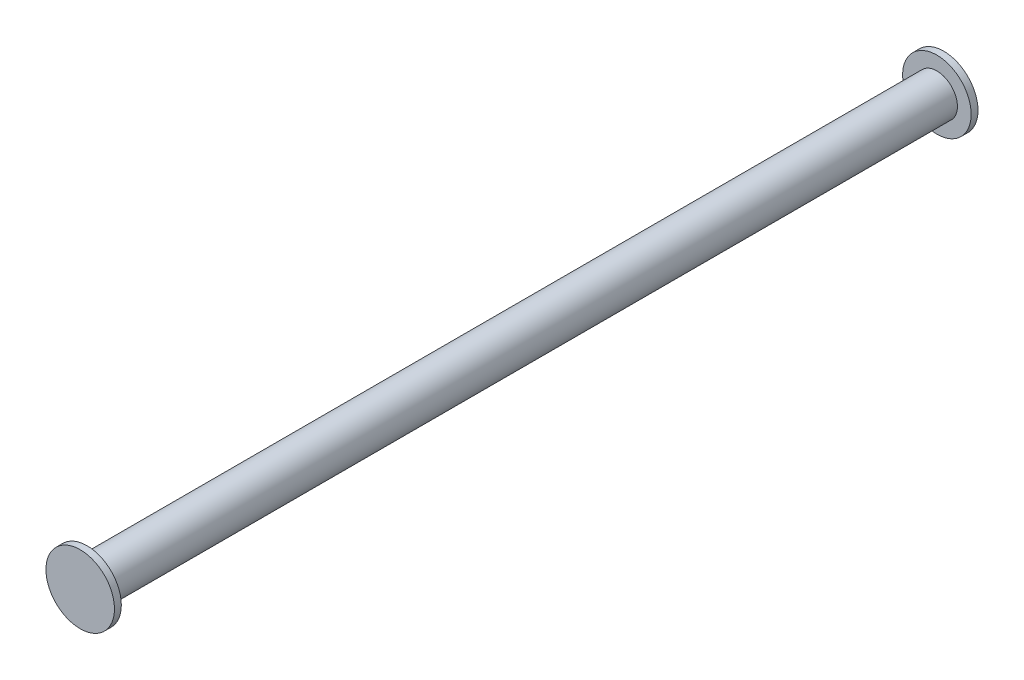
ISO-10303-21;
HEADER;
FILE_DESCRIPTION(('STEP AP214'),'2;1');
FILE_NAME('part.step','',(''),(''),'','','');
FILE_SCHEMA(('AUTOMOTIVE_DESIGN { 1 0 10303 214 1 1 1 1 }'));
ENDSEC;
DATA;
#1=APPLICATION_CONTEXT('core data for automotive mechanical design processes');
#2=APPLICATION_PROTOCOL_DEFINITION('international standard','automotive_design',2000,#1);
#3=PRODUCT_CONTEXT('',#1,'mechanical');
#4=PRODUCT('Part','Part','',(#3));
#5=PRODUCT_RELATED_PRODUCT_CATEGORY('part','',(#4));
#6=PRODUCT_DEFINITION_FORMATION('','',#4);
#7=PRODUCT_DEFINITION_CONTEXT('part definition',#1,'design');
#8=PRODUCT_DEFINITION('design','',#6,#7);
#9=PRODUCT_DEFINITION_SHAPE('','',#8);
#10=(LENGTH_UNIT() NAMED_UNIT(*) SI_UNIT(.MILLI.,.METRE.));
#11=(NAMED_UNIT(*) PLANE_ANGLE_UNIT() SI_UNIT($,.RADIAN.));
#12=(NAMED_UNIT(*) SI_UNIT($,.STERADIAN.) SOLID_ANGLE_UNIT());
#13=UNCERTAINTY_MEASURE_WITH_UNIT(LENGTH_MEASURE(1.E-05),#10,'distance_accuracy_value','');
#14=(GEOMETRIC_REPRESENTATION_CONTEXT(3) GLOBAL_UNCERTAINTY_ASSIGNED_CONTEXT((#13)) GLOBAL_UNIT_ASSIGNED_CONTEXT((#10,
#11,#12)) REPRESENTATION_CONTEXT('',''));
#15=CARTESIAN_POINT('',(0.,0.,0.));
#16=DIRECTION('',(0.,0.,1.));
#17=DIRECTION('',(1.,0.,0.));
#18=AXIS2_PLACEMENT_3D('',#15,#16,#17);
#19=CARTESIAN_POINT('',(0.,0.,-126.));
#20=DIRECTION('',(0.,0.,1.));
#21=DIRECTION('',(1.,0.,0.));
#22=AXIS2_PLACEMENT_3D('',#19,#20,#21);
#23=CYLINDRICAL_SURFACE('',#22,10.);
#24=CARTESIAN_POINT('',(0.,0.,-126.));
#25=DIRECTION('',(0.,0.,1.));
#26=DIRECTION('',(1.,0.,0.));
#27=AXIS2_PLACEMENT_3D('',#24,#25,#26);
#28=CIRCLE('',#27,10.);
#29=CARTESIAN_POINT('',(10.,0.,-126.));
#30=VERTEX_POINT('',#29);
#31=EDGE_CURVE('E10',#30,#30,#28,.T.);
#32=ORIENTED_EDGE('',*,*,#31,.T.);
#33=EDGE_LOOP('',(#32));
#34=FACE_BOUND('',#33,.T.);
#35=CARTESIAN_POINT('',(0.,0.,-124.));
#36=DIRECTION('',(0.,0.,1.));
#37=DIRECTION('',(1.,0.,0.));
#38=AXIS2_PLACEMENT_3D('',#35,#36,#37);
#39=CIRCLE('',#38,10.);
#40=CARTESIAN_POINT('',(10.,0.,-124.));
#41=VERTEX_POINT('',#40);
#42=EDGE_CURVE('E43',#41,#41,#39,.F.);
#43=ORIENTED_EDGE('',*,*,#42,.T.);
#44=EDGE_LOOP('',(#43));
#45=FACE_BOUND('',#44,.T.);
#46=ADVANCED_FACE('F39',(#34,#45),#23,.T.);
#47=CARTESIAN_POINT('',(0.,0.,-126.));
#48=DIRECTION('',(0.,0.,1.));
#49=DIRECTION('',(1.,0.,0.));
#50=AXIS2_PLACEMENT_3D('',#47,#48,#49);
#51=PLANE('',#50);
#52=ORIENTED_EDGE('',*,*,#31,.F.);
#53=EDGE_LOOP('',(#52));
#54=FACE_BOUND('',#53,.T.);
#55=ADVANCED_FACE('F84',(#54),#51,.F.);
#56=CARTESIAN_POINT('',(0.,0.,-124.));
#57=DIRECTION('',(0.,0.,1.));
#58=DIRECTION('',(1.,0.,0.));
#59=AXIS2_PLACEMENT_3D('',#56,#57,#58);
#60=PLANE('',#59);
#61=ORIENTED_EDGE('',*,*,#42,.F.);
#62=EDGE_LOOP('',(#61));
#63=FACE_BOUND('',#62,.T.);
#64=CARTESIAN_POINT('',(0.,0.,-124.));
#65=DIRECTION('',(0.,0.,1.));
#66=DIRECTION('',(1.,0.,0.));
#67=AXIS2_PLACEMENT_3D('',#64,#65,#66);
#68=CIRCLE('',#67,6.);
#69=CARTESIAN_POINT('',(6.,0.,-124.));
#70=VERTEX_POINT('',#69);
#71=EDGE_CURVE('E58',#70,#70,#68,.T.);
#72=ORIENTED_EDGE('',*,*,#71,.F.);
#73=EDGE_LOOP('',(#72));
#74=FACE_BOUND('',#73,.T.);
#75=ADVANCED_FACE('F80',(#63,#74),#60,.T.);
#76=CARTESIAN_POINT('',(0.,0.,124.));
#77=DIRECTION('',(0.,0.,1.));
#78=DIRECTION('',(1.,0.,0.));
#79=AXIS2_PLACEMENT_3D('',#76,#77,#78);
#80=PLANE('',#79);
#81=CARTESIAN_POINT('',(0.,0.,124.));
#82=DIRECTION('',(0.,0.,1.));
#83=DIRECTION('',(1.,0.,0.));
#84=AXIS2_PLACEMENT_3D('',#81,#82,#83);
#85=CIRCLE('',#84,10.);
#86=CARTESIAN_POINT('',(10.,0.,124.));
#87=VERTEX_POINT('',#86);
#88=EDGE_CURVE('E56',#87,#87,#85,.F.);
#89=ORIENTED_EDGE('',*,*,#88,.T.);
#90=EDGE_LOOP('',(#89));
#91=FACE_BOUND('',#90,.T.);
#92=CARTESIAN_POINT('',(0.,0.,124.));
#93=DIRECTION('',(0.,0.,1.));
#94=DIRECTION('',(1.,0.,0.));
#95=AXIS2_PLACEMENT_3D('',#92,#93,#94);
#96=CIRCLE('',#95,6.);
#97=CARTESIAN_POINT('',(6.,0.,124.));
#98=VERTEX_POINT('',#97);
#99=EDGE_CURVE('E54',#98,#98,#96,.T.);
#100=ORIENTED_EDGE('',*,*,#99,.T.);
#101=EDGE_LOOP('',(#100));
#102=FACE_BOUND('',#101,.T.);
#103=ADVANCED_FACE('F68',(#91,#102),#80,.F.);
#104=CARTESIAN_POINT('',(0.,0.,-124.));
#105=DIRECTION('',(0.,0.,1.));
#106=DIRECTION('',(1.,0.,0.));
#107=AXIS2_PLACEMENT_3D('',#104,#105,#106);
#108=CYLINDRICAL_SURFACE('',#107,6.);
#109=ORIENTED_EDGE('',*,*,#71,.T.);
#110=EDGE_LOOP('',(#109));
#111=FACE_BOUND('',#110,.T.);
#112=ORIENTED_EDGE('',*,*,#99,.F.);
#113=EDGE_LOOP('',(#112));
#114=FACE_BOUND('',#113,.T.);
#115=ADVANCED_FACE('F70',(#111,#114),#108,.T.);
#116=CARTESIAN_POINT('',(0.,0.,126.));
#117=DIRECTION('',(0.,0.,1.));
#118=DIRECTION('',(1.,0.,0.));
#119=AXIS2_PLACEMENT_3D('',#116,#117,#118);
#120=PLANE('',#119);
#121=CARTESIAN_POINT('',(0.,0.,126.));
#122=DIRECTION('',(0.,0.,1.));
#123=DIRECTION('',(1.,0.,0.));
#124=AXIS2_PLACEMENT_3D('',#121,#122,#123);
#125=CIRCLE('',#124,10.);
#126=CARTESIAN_POINT('',(10.,0.,126.));
#127=VERTEX_POINT('',#126);
#128=EDGE_CURVE('E47',#127,#127,#125,.T.);
#129=ORIENTED_EDGE('',*,*,#128,.T.);
#130=EDGE_LOOP('',(#129));
#131=FACE_BOUND('',#130,.T.);
#132=ADVANCED_FACE('F72',(#131),#120,.T.);
#133=ORIENTED_EDGE('',*,*,#88,.F.);
#134=EDGE_LOOP('',(#133));
#135=FACE_BOUND('',#134,.T.);
#136=ORIENTED_EDGE('',*,*,#128,.F.);
#137=EDGE_LOOP('',(#136));
#138=FACE_BOUND('',#137,.T.);
#139=ADVANCED_FACE('F41',(#135,#138),#23,.T.);
#140=CLOSED_SHELL('',(#46,#55,#75,#103,#115,#132,#139));
#141=MANIFOLD_SOLID_BREP('B2',#140);
#142=ADVANCED_BREP_SHAPE_REPRESENTATION('',(#18,#141),#14);
#143=SHAPE_DEFINITION_REPRESENTATION(#9,#142);
ENDSEC;
END-ISO-10303-21;
